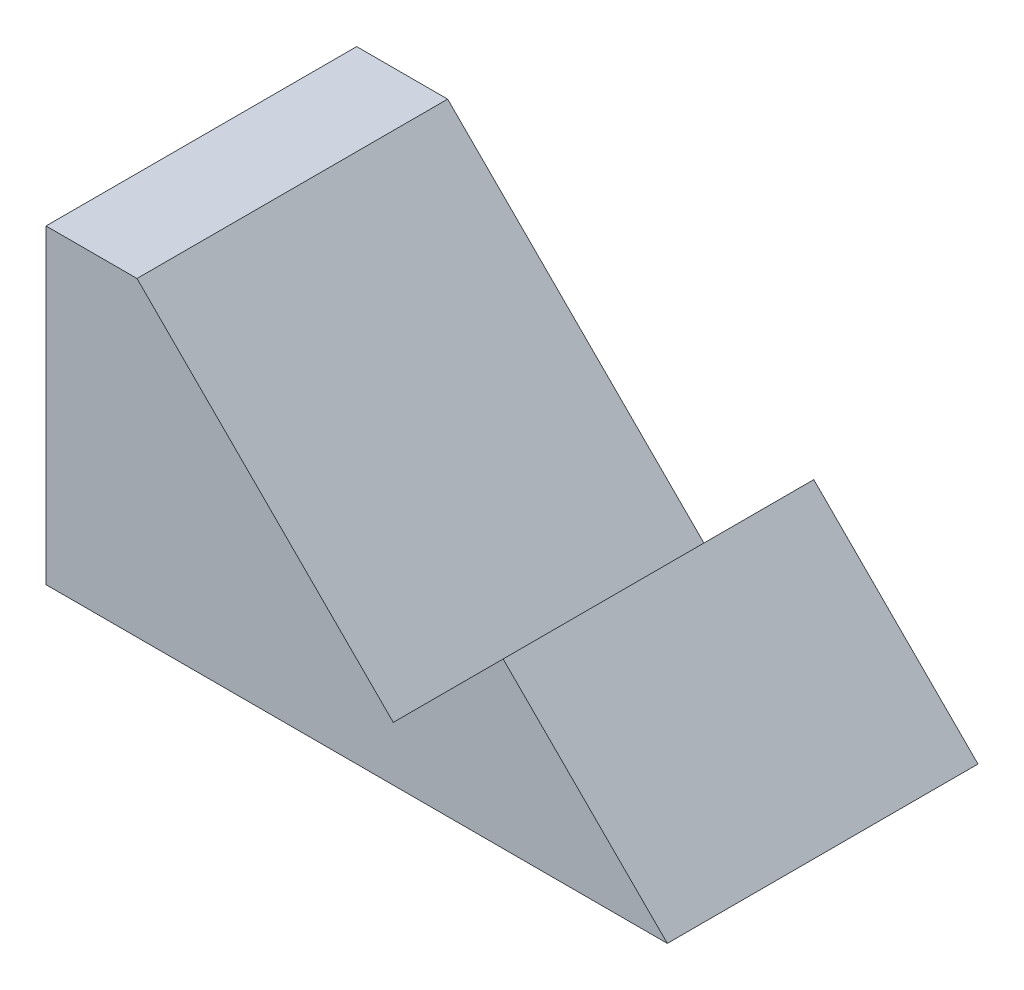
from build123d import *

# Parameters (mm, degrees)
EXTRUDE1_DEPTH = 38.1


with BuildPart() as part:
    # Sketch1 → Extrude1 (new body)
    with BuildSketch(Plane.XY):
        Polygon((0, 0), (76.2, 0), (56.060512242, 20.139487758), (42.590128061, 6.669103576), (11.159231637, 38.1), (0, 38.1), align=None)
    extrude(amount=EXTRUDE1_DEPTH)


solid = part.part
